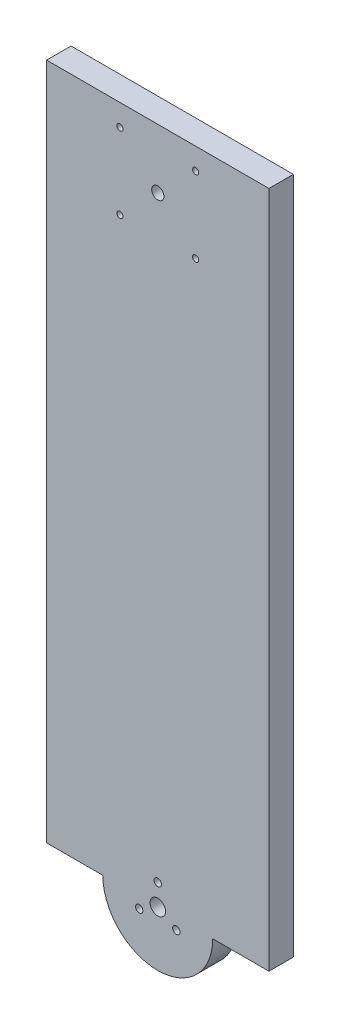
ISO-10303-21;
HEADER;
FILE_DESCRIPTION(('STEP AP214'),'2;1');
FILE_NAME('part.step','',(''),(''),'','','');
FILE_SCHEMA(('AUTOMOTIVE_DESIGN { 1 0 10303 214 1 1 1 1 }'));
ENDSEC;
DATA;
#1=APPLICATION_CONTEXT('core data for automotive mechanical design processes');
#2=APPLICATION_PROTOCOL_DEFINITION('international standard','automotive_design',2000,#1);
#3=PRODUCT_CONTEXT('',#1,'mechanical');
#4=PRODUCT('Part','Part','',(#3));
#5=PRODUCT_RELATED_PRODUCT_CATEGORY('part','',(#4));
#6=PRODUCT_DEFINITION_FORMATION('','',#4);
#7=PRODUCT_DEFINITION_CONTEXT('part definition',#1,'design');
#8=PRODUCT_DEFINITION('design','',#6,#7);
#9=PRODUCT_DEFINITION_SHAPE('','',#8);
#10=(LENGTH_UNIT() NAMED_UNIT(*) SI_UNIT(.MILLI.,.METRE.));
#11=(NAMED_UNIT(*) PLANE_ANGLE_UNIT() SI_UNIT($,.RADIAN.));
#12=(NAMED_UNIT(*) SI_UNIT($,.STERADIAN.) SOLID_ANGLE_UNIT());
#13=UNCERTAINTY_MEASURE_WITH_UNIT(LENGTH_MEASURE(1.E-05),#10,'distance_accuracy_value','');
#14=(GEOMETRIC_REPRESENTATION_CONTEXT(3) GLOBAL_UNCERTAINTY_ASSIGNED_CONTEXT((#13)) GLOBAL_UNIT_ASSIGNED_CONTEXT((#10,
#11,#12)) REPRESENTATION_CONTEXT('',''));
#15=CARTESIAN_POINT('',(0.,0.,0.));
#16=DIRECTION('',(0.,0.,1.));
#17=DIRECTION('',(1.,0.,0.));
#18=AXIS2_PLACEMENT_3D('',#15,#16,#17);
#19=CARTESIAN_POINT('',(-5.086209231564E-12,-147.5,10.));
#20=DIRECTION('',(0.,0.,1.));
#21=DIRECTION('',(1.,0.,0.));
#22=AXIS2_PLACEMENT_3D('',#19,#20,#21);
#23=PLANE('',#22);
#24=CARTESIAN_POINT('',(7.57772228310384,-151.875000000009,10.));
#25=DIRECTION('',(0.,0.,1.));
#26=DIRECTION('',(1.,0.,0.));
#27=AXIS2_PLACEMENT_3D('',#24,#25,#26);
#28=CIRCLE('',#27,1.5);
#29=CARTESIAN_POINT('',(9.07772228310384,-151.875000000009,10.));
#30=VERTEX_POINT('',#29);
#31=EDGE_CURVE('E134',#30,#30,#28,.T.);
#32=ORIENTED_EDGE('',*,*,#31,.F.);
#33=EDGE_LOOP('',(#32));
#34=FACE_BOUND('',#33,.T.);
#35=CARTESIAN_POINT('',(5.46489483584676E-12,-138.75,10.));
#36=DIRECTION('',(0.,0.,1.));
#37=DIRECTION('',(1.,0.,0.));
#38=AXIS2_PLACEMENT_3D('',#35,#36,#37);
#39=CIRCLE('',#38,1.5);
#40=CARTESIAN_POINT('',(1.50000000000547,-138.75,10.));
#41=VERTEX_POINT('',#40);
#42=EDGE_CURVE('E146',#41,#41,#39,.T.);
#43=ORIENTED_EDGE('',*,*,#42,.F.);
#44=EDGE_LOOP('',(#43));
#45=FACE_BOUND('',#44,.T.);
#46=CARTESIAN_POINT('',(-15.4999999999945,90.1639203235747,10.));
#47=DIRECTION('',(0.,0.,1.));
#48=DIRECTION('',(-1.,0.,0.));
#49=AXIS2_PLACEMENT_3D('',#46,#47,#48);
#50=CIRCLE('',#49,1.25);
#51=CARTESIAN_POINT('',(-16.7499999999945,90.1639203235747,10.));
#52=VERTEX_POINT('',#51);
#53=EDGE_CURVE('E158',#52,#52,#50,.T.);
#54=ORIENTED_EDGE('',*,*,#53,.F.);
#55=EDGE_LOOP('',(#54));
#56=FACE_BOUND('',#55,.T.);
#57=CARTESIAN_POINT('',(15.5000000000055,121.163920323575,10.));
#58=DIRECTION('',(0.,0.,1.));
#59=DIRECTION('',(-1.,0.,0.));
#60=AXIS2_PLACEMENT_3D('',#57,#58,#59);
#61=CIRCLE('',#60,1.25);
#62=CARTESIAN_POINT('',(14.2500000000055,121.163920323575,10.));
#63=VERTEX_POINT('',#62);
#64=EDGE_CURVE('E170',#63,#63,#61,.T.);
#65=ORIENTED_EDGE('',*,*,#64,.F.);
#66=EDGE_LOOP('',(#65));
#67=FACE_BOUND('',#66,.T.);
#68=DIRECTION('',(-1.,0.,0.));
#69=VECTOR('',#68,1.);
#70=CARTESIAN_POINT('',(-22.5,130.,10.));
#71=LINE('',#70,#69);
#72=CARTESIAN_POINT('',(45.5,130.,10.));
#73=VERTEX_POINT('',#72);
#74=CARTESIAN_POINT('',(-45.5,130.,10.));
#75=VERTEX_POINT('',#74);
#76=EDGE_CURVE('E182',#73,#75,#71,.T.);
#77=ORIENTED_EDGE('',*,*,#76,.T.);
#78=DIRECTION('',(0.,1.,0.));
#79=VECTOR('',#78,1.);
#80=CARTESIAN_POINT('',(-45.5,130.,10.));
#81=LINE('',#80,#79);
#82=CARTESIAN_POINT('',(-45.5000000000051,-147.5,10.));
#83=VERTEX_POINT('',#82);
#84=EDGE_CURVE('E93',#83,#75,#81,.T.);
#85=ORIENTED_EDGE('',*,*,#84,.F.);
#86=DIRECTION('',(1.,0.,0.));
#87=VECTOR('',#86,1.);
#88=CARTESIAN_POINT('',(-45.5000000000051,-147.5,10.));
#89=LINE('',#88,#87);
#90=CARTESIAN_POINT('',(-22.5000000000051,-147.5,10.));
#91=VERTEX_POINT('',#90);
#92=EDGE_CURVE('E89',#83,#91,#89,.T.);
#93=ORIENTED_EDGE('',*,*,#92,.T.);
#94=CARTESIAN_POINT('',(-5.086209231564E-12,-147.5,10.));
#95=DIRECTION('',(0.,0.,1.));
#96=DIRECTION('',(1.,0.,0.));
#97=AXIS2_PLACEMENT_3D('',#94,#95,#96);
#98=CIRCLE('',#97,22.5);
#99=CARTESIAN_POINT('',(22.4999999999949,-147.5,10.));
#100=VERTEX_POINT('',#99);
#101=EDGE_CURVE('E47',#91,#100,#98,.T.);
#102=ORIENTED_EDGE('',*,*,#101,.T.);
#103=DIRECTION('',(-1.,0.,0.));
#104=VECTOR('',#103,1.);
#105=CARTESIAN_POINT('',(45.4999999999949,-147.5,10.));
#106=LINE('',#105,#104);
#107=CARTESIAN_POINT('',(45.4999999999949,-147.5,10.));
#108=VERTEX_POINT('',#107);
#109=EDGE_CURVE('E125',#108,#100,#106,.T.);
#110=ORIENTED_EDGE('',*,*,#109,.F.);
#111=DIRECTION('',(0.,-1.,0.));
#112=VECTOR('',#111,1.);
#113=CARTESIAN_POINT('',(45.5,130.,10.));
#114=LINE('',#113,#112);
#115=EDGE_CURVE('E108',#73,#108,#114,.T.);
#116=ORIENTED_EDGE('',*,*,#115,.F.);
#117=EDGE_LOOP('',(#77,#85,#93,#102,#110,#116));
#118=FACE_BOUND('',#117,.T.);
#119=CARTESIAN_POINT('',(-15.4999999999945,121.163920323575,10.));
#120=DIRECTION('',(0.,0.,1.));
#121=DIRECTION('',(1.,0.,0.));
#122=AXIS2_PLACEMENT_3D('',#119,#120,#121);
#123=CIRCLE('',#122,1.25);
#124=CARTESIAN_POINT('',(-14.2499999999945,121.163920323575,10.));
#125=VERTEX_POINT('',#124);
#126=EDGE_CURVE('E176',#125,#125,#123,.T.);
#127=ORIENTED_EDGE('',*,*,#126,.F.);
#128=EDGE_LOOP('',(#127));
#129=FACE_BOUND('',#128,.T.);
#130=CARTESIAN_POINT('',(15.5000000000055,90.1639203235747,10.));
#131=DIRECTION('',(0.,0.,1.));
#132=DIRECTION('',(1.,0.,0.));
#133=AXIS2_PLACEMENT_3D('',#130,#131,#132);
#134=CIRCLE('',#133,1.25);
#135=CARTESIAN_POINT('',(16.7500000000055,90.1639203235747,10.));
#136=VERTEX_POINT('',#135);
#137=EDGE_CURVE('E164',#136,#136,#134,.T.);
#138=ORIENTED_EDGE('',*,*,#137,.F.);
#139=EDGE_LOOP('',(#138));
#140=FACE_BOUND('',#139,.T.);
#141=CARTESIAN_POINT('',(5.4678483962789E-12,105.663920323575,10.));
#142=DIRECTION('',(0.,0.,1.));
#143=DIRECTION('',(1.,0.,0.));
#144=AXIS2_PLACEMENT_3D('',#141,#142,#143);
#145=CIRCLE('',#144,2.5);
#146=CARTESIAN_POINT('',(2.50000000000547,105.663920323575,10.));
#147=VERTEX_POINT('',#146);
#148=EDGE_CURVE('E152',#147,#147,#145,.T.);
#149=ORIENTED_EDGE('',*,*,#148,.F.);
#150=EDGE_LOOP('',(#149));
#151=FACE_BOUND('',#150,.T.);
#152=CARTESIAN_POINT('',(-5.086209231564E-12,-147.5,10.));
#153=DIRECTION('',(0.,0.,1.));
#154=DIRECTION('',(1.,0.,0.));
#155=AXIS2_PLACEMENT_3D('',#152,#153,#154);
#156=CIRCLE('',#155,3.15);
#157=CARTESIAN_POINT('',(3.14999999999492,-147.5,10.));
#158=VERTEX_POINT('',#157);
#159=EDGE_CURVE('E140',#158,#158,#156,.T.);
#160=ORIENTED_EDGE('',*,*,#159,.F.);
#161=EDGE_LOOP('',(#160));
#162=FACE_BOUND('',#161,.T.);
#163=CARTESIAN_POINT('',(-7.57772228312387,-151.874999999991,10.));
#164=DIRECTION('',(0.,0.,1.));
#165=DIRECTION('',(1.,0.,0.));
#166=AXIS2_PLACEMENT_3D('',#163,#164,#165);
#167=CIRCLE('',#166,1.49999999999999);
#168=CARTESIAN_POINT('',(-6.07772228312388,-151.874999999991,10.));
#169=VERTEX_POINT('',#168);
#170=EDGE_CURVE('E128',#169,#169,#167,.T.);
#171=ORIENTED_EDGE('',*,*,#170,.F.);
#172=EDGE_LOOP('',(#171));
#173=FACE_BOUND('',#172,.T.);
#174=ADVANCED_FACE('F33',(#34,#45,#56,#67,#118,#129,#140,#151,#162,#173),#23,.T.);
#175=CARTESIAN_POINT('',(-5.086209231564E-12,-147.5,0.));
#176=DIRECTION('',(0.,0.,1.));
#177=DIRECTION('',(1.,0.,0.));
#178=AXIS2_PLACEMENT_3D('',#175,#176,#177);
#179=PLANE('',#178);
#180=CARTESIAN_POINT('',(-5.086209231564E-12,-147.5,0.));
#181=DIRECTION('',(0.,0.,1.));
#182=DIRECTION('',(1.,0.,0.));
#183=AXIS2_PLACEMENT_3D('',#180,#181,#182);
#184=CIRCLE('',#183,22.5);
#185=CARTESIAN_POINT('',(-22.5000000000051,-147.5,0.));
#186=VERTEX_POINT('',#185);
#187=CARTESIAN_POINT('',(22.4999999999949,-147.5,0.));
#188=VERTEX_POINT('',#187);
#189=EDGE_CURVE('E107',#186,#188,#184,.T.);
#190=ORIENTED_EDGE('',*,*,#189,.F.);
#191=DIRECTION('',(1.,0.,0.));
#192=VECTOR('',#191,1.);
#193=CARTESIAN_POINT('',(-45.5000000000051,-147.5,0.));
#194=LINE('',#193,#192);
#195=CARTESIAN_POINT('',(-45.5000000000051,-147.5,0.));
#196=VERTEX_POINT('',#195);
#197=EDGE_CURVE('E87',#196,#186,#194,.T.);
#198=ORIENTED_EDGE('',*,*,#197,.F.);
#199=DIRECTION('',(0.,-1.,0.));
#200=VECTOR('',#199,1.);
#201=CARTESIAN_POINT('',(-45.5,130.,0.));
#202=LINE('',#201,#200);
#203=CARTESIAN_POINT('',(-45.5,130.,0.));
#204=VERTEX_POINT('',#203);
#205=EDGE_CURVE('E94',#204,#196,#202,.T.);
#206=ORIENTED_EDGE('',*,*,#205,.F.);
#207=DIRECTION('',(-1.,0.,0.));
#208=VECTOR('',#207,1.);
#209=CARTESIAN_POINT('',(-22.5,130.,0.));
#210=LINE('',#209,#208);
#211=CARTESIAN_POINT('',(45.5,130.,0.));
#212=VERTEX_POINT('',#211);
#213=EDGE_CURVE('E183',#212,#204,#210,.T.);
#214=ORIENTED_EDGE('',*,*,#213,.F.);
#215=DIRECTION('',(0.,1.,0.));
#216=VECTOR('',#215,1.);
#217=CARTESIAN_POINT('',(45.5,130.,0.));
#218=LINE('',#217,#216);
#219=CARTESIAN_POINT('',(45.4999999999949,-147.5,0.));
#220=VERTEX_POINT('',#219);
#221=EDGE_CURVE('E117',#220,#212,#218,.T.);
#222=ORIENTED_EDGE('',*,*,#221,.F.);
#223=DIRECTION('',(-1.,0.,0.));
#224=VECTOR('',#223,1.);
#225=CARTESIAN_POINT('',(45.4999999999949,-147.5,0.));
#226=LINE('',#225,#224);
#227=EDGE_CURVE('E123',#220,#188,#226,.T.);
#228=ORIENTED_EDGE('',*,*,#227,.T.);
#229=EDGE_LOOP('',(#190,#198,#206,#214,#222,#228));
#230=FACE_BOUND('',#229,.T.);
#231=CARTESIAN_POINT('',(-15.4999999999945,121.163920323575,0.));
#232=DIRECTION('',(0.,0.,1.));
#233=DIRECTION('',(1.,0.,0.));
#234=AXIS2_PLACEMENT_3D('',#231,#232,#233);
#235=CIRCLE('',#234,1.25);
#236=CARTESIAN_POINT('',(-14.2499999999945,121.163920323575,0.));
#237=VERTEX_POINT('',#236);
#238=EDGE_CURVE('E173',#237,#237,#235,.T.);
#239=ORIENTED_EDGE('',*,*,#238,.T.);
#240=EDGE_LOOP('',(#239));
#241=FACE_BOUND('',#240,.T.);
#242=CARTESIAN_POINT('',(15.5000000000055,121.163920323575,0.));
#243=DIRECTION('',(0.,0.,1.));
#244=DIRECTION('',(-1.,0.,0.));
#245=AXIS2_PLACEMENT_3D('',#242,#243,#244);
#246=CIRCLE('',#245,1.25);
#247=CARTESIAN_POINT('',(14.2500000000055,121.163920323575,0.));
#248=VERTEX_POINT('',#247);
#249=EDGE_CURVE('E167',#248,#248,#246,.T.);
#250=ORIENTED_EDGE('',*,*,#249,.T.);
#251=EDGE_LOOP('',(#250));
#252=FACE_BOUND('',#251,.T.);
#253=CARTESIAN_POINT('',(15.5000000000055,90.1639203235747,0.));
#254=DIRECTION('',(0.,0.,1.));
#255=DIRECTION('',(1.,0.,0.));
#256=AXIS2_PLACEMENT_3D('',#253,#254,#255);
#257=CIRCLE('',#256,1.25);
#258=CARTESIAN_POINT('',(16.7500000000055,90.1639203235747,0.));
#259=VERTEX_POINT('',#258);
#260=EDGE_CURVE('E161',#259,#259,#257,.T.);
#261=ORIENTED_EDGE('',*,*,#260,.T.);
#262=EDGE_LOOP('',(#261));
#263=FACE_BOUND('',#262,.T.);
#264=CARTESIAN_POINT('',(-15.4999999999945,90.1639203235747,0.));
#265=DIRECTION('',(0.,0.,1.));
#266=DIRECTION('',(-1.,0.,0.));
#267=AXIS2_PLACEMENT_3D('',#264,#265,#266);
#268=CIRCLE('',#267,1.25);
#269=CARTESIAN_POINT('',(-16.7499999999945,90.1639203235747,0.));
#270=VERTEX_POINT('',#269);
#271=EDGE_CURVE('E155',#270,#270,#268,.T.);
#272=ORIENTED_EDGE('',*,*,#271,.T.);
#273=EDGE_LOOP('',(#272));
#274=FACE_BOUND('',#273,.T.);
#275=CARTESIAN_POINT('',(5.4678483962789E-12,105.663920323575,0.));
#276=DIRECTION('',(0.,0.,1.));
#277=DIRECTION('',(1.,0.,0.));
#278=AXIS2_PLACEMENT_3D('',#275,#276,#277);
#279=CIRCLE('',#278,2.5);
#280=CARTESIAN_POINT('',(2.50000000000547,105.663920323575,0.));
#281=VERTEX_POINT('',#280);
#282=EDGE_CURVE('E149',#281,#281,#279,.T.);
#283=ORIENTED_EDGE('',*,*,#282,.T.);
#284=EDGE_LOOP('',(#283));
#285=FACE_BOUND('',#284,.T.);
#286=CARTESIAN_POINT('',(5.46489483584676E-12,-138.75,0.));
#287=DIRECTION('',(0.,0.,1.));
#288=DIRECTION('',(1.,0.,0.));
#289=AXIS2_PLACEMENT_3D('',#286,#287,#288);
#290=CIRCLE('',#289,1.5);
#291=CARTESIAN_POINT('',(1.50000000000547,-138.75,0.));
#292=VERTEX_POINT('',#291);
#293=EDGE_CURVE('E143',#292,#292,#290,.T.);
#294=ORIENTED_EDGE('',*,*,#293,.T.);
#295=EDGE_LOOP('',(#294));
#296=FACE_BOUND('',#295,.T.);
#297=CARTESIAN_POINT('',(-5.086209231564E-12,-147.5,0.));
#298=DIRECTION('',(0.,0.,1.));
#299=DIRECTION('',(1.,0.,0.));
#300=AXIS2_PLACEMENT_3D('',#297,#298,#299);
#301=CIRCLE('',#300,3.15);
#302=CARTESIAN_POINT('',(3.14999999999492,-147.5,0.));
#303=VERTEX_POINT('',#302);
#304=EDGE_CURVE('E137',#303,#303,#301,.T.);
#305=ORIENTED_EDGE('',*,*,#304,.T.);
#306=EDGE_LOOP('',(#305));
#307=FACE_BOUND('',#306,.T.);
#308=CARTESIAN_POINT('',(7.57772228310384,-151.875000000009,0.));
#309=DIRECTION('',(0.,0.,1.));
#310=DIRECTION('',(1.,0.,0.));
#311=AXIS2_PLACEMENT_3D('',#308,#309,#310);
#312=CIRCLE('',#311,1.5);
#313=CARTESIAN_POINT('',(9.07772228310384,-151.875000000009,0.));
#314=VERTEX_POINT('',#313);
#315=EDGE_CURVE('E131',#314,#314,#312,.T.);
#316=ORIENTED_EDGE('',*,*,#315,.T.);
#317=EDGE_LOOP('',(#316));
#318=FACE_BOUND('',#317,.T.);
#319=CARTESIAN_POINT('',(-7.57772228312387,-151.874999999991,0.));
#320=DIRECTION('',(0.,0.,1.));
#321=DIRECTION('',(1.,0.,0.));
#322=AXIS2_PLACEMENT_3D('',#319,#320,#321);
#323=CIRCLE('',#322,1.49999999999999);
#324=CARTESIAN_POINT('',(-6.07772228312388,-151.874999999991,0.));
#325=VERTEX_POINT('',#324);
#326=EDGE_CURVE('E127',#325,#325,#323,.T.);
#327=ORIENTED_EDGE('',*,*,#326,.T.);
#328=EDGE_LOOP('',(#327));
#329=FACE_BOUND('',#328,.T.);
#330=ADVANCED_FACE('F103',(#230,#241,#252,#263,#274,#285,#296,#307,#318,#329),#179,.F.);
#331=CARTESIAN_POINT('',(-5.086209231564E-12,-147.5,10.));
#332=DIRECTION('',(0.,0.,-1.));
#333=DIRECTION('',(-1.,0.,0.));
#334=AXIS2_PLACEMENT_3D('',#331,#332,#333);
#335=CYLINDRICAL_SURFACE('',#334,22.5);
#336=ORIENTED_EDGE('',*,*,#189,.T.);
#337=DIRECTION('',(0.,0.,-1.));
#338=VECTOR('',#337,1.);
#339=CARTESIAN_POINT('',(22.4999999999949,-147.5,10.));
#340=LINE('',#339,#338);
#341=EDGE_CURVE('E42',#100,#188,#340,.T.);
#342=ORIENTED_EDGE('',*,*,#341,.F.);
#343=ORIENTED_EDGE('',*,*,#101,.F.);
#344=DIRECTION('',(0.,0.,-1.));
#345=VECTOR('',#344,1.);
#346=CARTESIAN_POINT('',(-22.5000000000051,-147.5,10.));
#347=LINE('',#346,#345);
#348=EDGE_CURVE('E11',#91,#186,#347,.T.);
#349=ORIENTED_EDGE('',*,*,#348,.T.);
#350=EDGE_LOOP('',(#336,#342,#343,#349));
#351=FACE_BOUND('',#350,.T.);
#352=ADVANCED_FACE('F35',(#351),#335,.T.);
#353=CARTESIAN_POINT('',(-22.5,130.,10.));
#354=DIRECTION('',(0.,-1.,0.));
#355=DIRECTION('',(0.,0.,-1.));
#356=AXIS2_PLACEMENT_3D('',#353,#354,#355);
#357=PLANE('',#356);
#358=ORIENTED_EDGE('',*,*,#213,.T.);
#359=DIRECTION('',(0.,0.,-1.));
#360=VECTOR('',#359,1.);
#361=CARTESIAN_POINT('',(-45.5,130.,0.));
#362=LINE('',#361,#360);
#363=EDGE_CURVE('E100',#75,#204,#362,.T.);
#364=ORIENTED_EDGE('',*,*,#363,.F.);
#365=ORIENTED_EDGE('',*,*,#76,.F.);
#366=DIRECTION('',(0.,0.,1.));
#367=VECTOR('',#366,1.);
#368=CARTESIAN_POINT('',(45.5,130.,10.));
#369=LINE('',#368,#367);
#370=EDGE_CURVE('E120',#212,#73,#369,.T.);
#371=ORIENTED_EDGE('',*,*,#370,.F.);
#372=EDGE_LOOP('',(#358,#364,#365,#371));
#373=FACE_BOUND('',#372,.T.);
#374=ADVANCED_FACE('F196',(#373),#357,.F.);
#375=CARTESIAN_POINT('',(-15.4999999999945,121.163920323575,10.));
#376=DIRECTION('',(0.,0.,-1.));
#377=DIRECTION('',(-1.,0.,0.));
#378=AXIS2_PLACEMENT_3D('',#375,#376,#377);
#379=CYLINDRICAL_SURFACE('',#378,1.25);
#380=ORIENTED_EDGE('',*,*,#126,.T.);
#381=EDGE_LOOP('',(#380));
#382=FACE_BOUND('',#381,.T.);
#383=ORIENTED_EDGE('',*,*,#238,.F.);
#384=EDGE_LOOP('',(#383));
#385=FACE_BOUND('',#384,.T.);
#386=ADVANCED_FACE('F220',(#382,#385),#379,.F.);
#387=CARTESIAN_POINT('',(15.5000000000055,121.163920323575,10.));
#388=DIRECTION('',(0.,0.,-1.));
#389=DIRECTION('',(-1.,0.,0.));
#390=AXIS2_PLACEMENT_3D('',#387,#388,#389);
#391=CYLINDRICAL_SURFACE('',#390,1.25);
#392=ORIENTED_EDGE('',*,*,#64,.T.);
#393=EDGE_LOOP('',(#392));
#394=FACE_BOUND('',#393,.T.);
#395=ORIENTED_EDGE('',*,*,#249,.F.);
#396=EDGE_LOOP('',(#395));
#397=FACE_BOUND('',#396,.T.);
#398=ADVANCED_FACE('F226',(#394,#397),#391,.F.);
#399=CARTESIAN_POINT('',(15.5000000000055,90.1639203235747,10.));
#400=DIRECTION('',(0.,0.,-1.));
#401=DIRECTION('',(-1.,0.,0.));
#402=AXIS2_PLACEMENT_3D('',#399,#400,#401);
#403=CYLINDRICAL_SURFACE('',#402,1.25);
#404=ORIENTED_EDGE('',*,*,#137,.T.);
#405=EDGE_LOOP('',(#404));
#406=FACE_BOUND('',#405,.T.);
#407=ORIENTED_EDGE('',*,*,#260,.F.);
#408=EDGE_LOOP('',(#407));
#409=FACE_BOUND('',#408,.T.);
#410=ADVANCED_FACE('F336',(#406,#409),#403,.F.);
#411=CARTESIAN_POINT('',(-15.4999999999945,90.1639203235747,10.));
#412=DIRECTION('',(0.,0.,-1.));
#413=DIRECTION('',(-1.,0.,0.));
#414=AXIS2_PLACEMENT_3D('',#411,#412,#413);
#415=CYLINDRICAL_SURFACE('',#414,1.25);
#416=ORIENTED_EDGE('',*,*,#53,.T.);
#417=EDGE_LOOP('',(#416));
#418=FACE_BOUND('',#417,.T.);
#419=ORIENTED_EDGE('',*,*,#271,.F.);
#420=EDGE_LOOP('',(#419));
#421=FACE_BOUND('',#420,.T.);
#422=ADVANCED_FACE('F326',(#418,#421),#415,.F.);
#423=CARTESIAN_POINT('',(5.4678483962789E-12,105.663920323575,10.));
#424=DIRECTION('',(0.,0.,-1.));
#425=DIRECTION('',(-1.,0.,0.));
#426=AXIS2_PLACEMENT_3D('',#423,#424,#425);
#427=CYLINDRICAL_SURFACE('',#426,2.5);
#428=ORIENTED_EDGE('',*,*,#148,.T.);
#429=EDGE_LOOP('',(#428));
#430=FACE_BOUND('',#429,.T.);
#431=ORIENTED_EDGE('',*,*,#282,.F.);
#432=EDGE_LOOP('',(#431));
#433=FACE_BOUND('',#432,.T.);
#434=ADVANCED_FACE('F316',(#430,#433),#427,.F.);
#435=CARTESIAN_POINT('',(5.46489483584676E-12,-138.75,10.));
#436=DIRECTION('',(0.,0.,-1.));
#437=DIRECTION('',(-1.,0.,0.));
#438=AXIS2_PLACEMENT_3D('',#435,#436,#437);
#439=CYLINDRICAL_SURFACE('',#438,1.5);
#440=ORIENTED_EDGE('',*,*,#42,.T.);
#441=EDGE_LOOP('',(#440));
#442=FACE_BOUND('',#441,.T.);
#443=ORIENTED_EDGE('',*,*,#293,.F.);
#444=EDGE_LOOP('',(#443));
#445=FACE_BOUND('',#444,.T.);
#446=ADVANCED_FACE('F306',(#442,#445),#439,.F.);
#447=CARTESIAN_POINT('',(-5.086209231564E-12,-147.5,10.));
#448=DIRECTION('',(0.,0.,-1.));
#449=DIRECTION('',(-1.,0.,0.));
#450=AXIS2_PLACEMENT_3D('',#447,#448,#449);
#451=CYLINDRICAL_SURFACE('',#450,3.15);
#452=ORIENTED_EDGE('',*,*,#159,.T.);
#453=EDGE_LOOP('',(#452));
#454=FACE_BOUND('',#453,.T.);
#455=ORIENTED_EDGE('',*,*,#304,.F.);
#456=EDGE_LOOP('',(#455));
#457=FACE_BOUND('',#456,.T.);
#458=ADVANCED_FACE('F296',(#454,#457),#451,.F.);
#459=CARTESIAN_POINT('',(7.57772228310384,-151.875000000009,10.));
#460=DIRECTION('',(0.,0.,-1.));
#461=DIRECTION('',(-1.,0.,0.));
#462=AXIS2_PLACEMENT_3D('',#459,#460,#461);
#463=CYLINDRICAL_SURFACE('',#462,1.5);
#464=ORIENTED_EDGE('',*,*,#31,.T.);
#465=EDGE_LOOP('',(#464));
#466=FACE_BOUND('',#465,.T.);
#467=ORIENTED_EDGE('',*,*,#315,.F.);
#468=EDGE_LOOP('',(#467));
#469=FACE_BOUND('',#468,.T.);
#470=ADVANCED_FACE('F286',(#466,#469),#463,.F.);
#471=CARTESIAN_POINT('',(-7.57772228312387,-151.874999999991,10.));
#472=DIRECTION('',(0.,0.,-1.));
#473=DIRECTION('',(-1.,0.,0.));
#474=AXIS2_PLACEMENT_3D('',#471,#472,#473);
#475=CYLINDRICAL_SURFACE('',#474,1.49999999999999);
#476=ORIENTED_EDGE('',*,*,#170,.T.);
#477=EDGE_LOOP('',(#476));
#478=FACE_BOUND('',#477,.T.);
#479=ORIENTED_EDGE('',*,*,#326,.F.);
#480=EDGE_LOOP('',(#479));
#481=FACE_BOUND('',#480,.T.);
#482=ADVANCED_FACE('F207',(#478,#481),#475,.F.);
#483=CARTESIAN_POINT('',(45.4999999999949,-147.5,10.));
#484=DIRECTION('',(0.,1.,0.));
#485=DIRECTION('',(-1.,0.,0.));
#486=AXIS2_PLACEMENT_3D('',#483,#484,#485);
#487=PLANE('',#486);
#488=ORIENTED_EDGE('',*,*,#341,.T.);
#489=ORIENTED_EDGE('',*,*,#227,.F.);
#490=DIRECTION('',(0.,0.,-1.));
#491=VECTOR('',#490,1.);
#492=CARTESIAN_POINT('',(45.4999999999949,-147.5,10.));
#493=LINE('',#492,#491);
#494=EDGE_CURVE('E111',#108,#220,#493,.T.);
#495=ORIENTED_EDGE('',*,*,#494,.F.);
#496=ORIENTED_EDGE('',*,*,#109,.T.);
#497=EDGE_LOOP('',(#488,#489,#495,#496));
#498=FACE_BOUND('',#497,.T.);
#499=ADVANCED_FACE('F188',(#498),#487,.F.);
#500=CARTESIAN_POINT('',(45.4999999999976,-8.31679570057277E-13,0.));
#501=DIRECTION('',(1.,0.,0.));
#502=DIRECTION('',(0.,1.,0.));
#503=AXIS2_PLACEMENT_3D('',#500,#501,#502);
#504=PLANE('',#503);
#505=ORIENTED_EDGE('',*,*,#115,.T.);
#506=ORIENTED_EDGE('',*,*,#494,.T.);
#507=ORIENTED_EDGE('',*,*,#221,.T.);
#508=ORIENTED_EDGE('',*,*,#370,.T.);
#509=EDGE_LOOP('',(#505,#506,#507,#508));
#510=FACE_BOUND('',#509,.T.);
#511=ADVANCED_FACE('F199',(#510),#504,.T.);
#512=CARTESIAN_POINT('',(-45.5000000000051,-147.5,0.));
#513=DIRECTION('',(0.,1.,0.));
#514=DIRECTION('',(-1.,0.,0.));
#515=AXIS2_PLACEMENT_3D('',#512,#513,#514);
#516=PLANE('',#515);
#517=ORIENTED_EDGE('',*,*,#348,.F.);
#518=ORIENTED_EDGE('',*,*,#92,.F.);
#519=DIRECTION('',(0.,0.,1.));
#520=VECTOR('',#519,1.);
#521=CARTESIAN_POINT('',(-45.5000000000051,-147.5,0.));
#522=LINE('',#521,#520);
#523=EDGE_CURVE('E83',#196,#83,#522,.T.);
#524=ORIENTED_EDGE('',*,*,#523,.F.);
#525=ORIENTED_EDGE('',*,*,#197,.T.);
#526=EDGE_LOOP('',(#517,#518,#524,#525));
#527=FACE_BOUND('',#526,.T.);
#528=ADVANCED_FACE('F85',(#527),#516,.F.);
#529=CARTESIAN_POINT('',(-45.5000000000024,8.31679570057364E-13,0.));
#530=DIRECTION('',(-1.,0.,0.));
#531=DIRECTION('',(0.,-1.,0.));
#532=AXIS2_PLACEMENT_3D('',#529,#530,#531);
#533=PLANE('',#532);
#534=ORIENTED_EDGE('',*,*,#205,.T.);
#535=ORIENTED_EDGE('',*,*,#523,.T.);
#536=ORIENTED_EDGE('',*,*,#84,.T.);
#537=ORIENTED_EDGE('',*,*,#363,.T.);
#538=EDGE_LOOP('',(#534,#535,#536,#537));
#539=FACE_BOUND('',#538,.T.);
#540=ADVANCED_FACE('F98',(#539),#533,.T.);
#541=CLOSED_SHELL('',(#174,#330,#352,#374,#386,#398,#410,#422,#434,#446,#458,#470,#482,#499,
#511,#528,#540));
#542=MANIFOLD_SOLID_BREP('B2',#541);
#543=ADVANCED_BREP_SHAPE_REPRESENTATION('',(#18,#542),#14);
#544=SHAPE_DEFINITION_REPRESENTATION(#9,#543);
ENDSEC;
END-ISO-10303-21;
